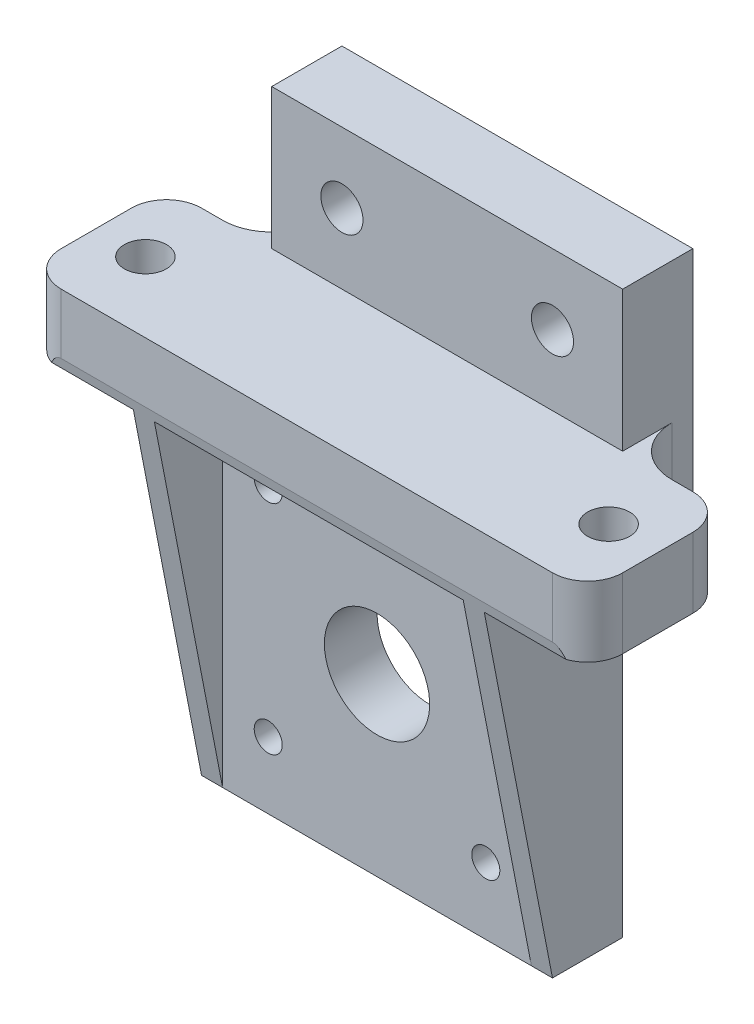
ISO-10303-21;
HEADER;
FILE_DESCRIPTION(('STEP AP214'),'2;1');
FILE_NAME('part.step','',(''),(''),'','','');
FILE_SCHEMA(('AUTOMOTIVE_DESIGN { 1 0 10303 214 1 1 1 1 }'));
ENDSEC;
DATA;
#1=APPLICATION_CONTEXT('core data for automotive mechanical design processes');
#2=APPLICATION_PROTOCOL_DEFINITION('international standard','automotive_design',2000,#1);
#3=PRODUCT_CONTEXT('',#1,'mechanical');
#4=PRODUCT('Part','Part','',(#3));
#5=PRODUCT_RELATED_PRODUCT_CATEGORY('part','',(#4));
#6=PRODUCT_DEFINITION_FORMATION('','',#4);
#7=PRODUCT_DEFINITION_CONTEXT('part definition',#1,'design');
#8=PRODUCT_DEFINITION('design','',#6,#7);
#9=PRODUCT_DEFINITION_SHAPE('','',#8);
#10=(LENGTH_UNIT() NAMED_UNIT(*) SI_UNIT(.MILLI.,.METRE.));
#11=(NAMED_UNIT(*) PLANE_ANGLE_UNIT() SI_UNIT($,.RADIAN.));
#12=(NAMED_UNIT(*) SI_UNIT($,.STERADIAN.) SOLID_ANGLE_UNIT());
#13=UNCERTAINTY_MEASURE_WITH_UNIT(LENGTH_MEASURE(1.E-05),#10,'distance_accuracy_value','');
#14=(GEOMETRIC_REPRESENTATION_CONTEXT(3) GLOBAL_UNCERTAINTY_ASSIGNED_CONTEXT((#13)) GLOBAL_UNIT_ASSIGNED_CONTEXT((#10,
#11,#12)) REPRESENTATION_CONTEXT('',''));
#15=CARTESIAN_POINT('',(0.,0.,0.));
#16=DIRECTION('',(0.,0.,1.));
#17=DIRECTION('',(1.,0.,0.));
#18=AXIS2_PLACEMENT_3D('',#15,#16,#17);
#19=CARTESIAN_POINT('',(0.,0.,10.));
#20=DIRECTION('',(0.,0.,1.));
#21=DIRECTION('',(1.,0.,0.));
#22=AXIS2_PLACEMENT_3D('',#19,#20,#21);
#23=PLANE('',#22);
#24=CARTESIAN_POINT('',(-52.2762597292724,18.5351099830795,10.));
#25=DIRECTION('',(0.,0.,-1.));
#26=DIRECTION('',(-1.,0.,0.));
#27=AXIS2_PLACEMENT_3D('',#24,#25,#26);
#28=CIRCLE('',#27,2.);
#29=CARTESIAN_POINT('',(-54.2762597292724,18.5351099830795,10.));
#30=VERTEX_POINT('',#29);
#31=EDGE_CURVE('E464',#30,#30,#28,.T.);
#32=ORIENTED_EDGE('',*,*,#31,.T.);
#33=EDGE_LOOP('',(#32));
#34=FACE_BOUND('',#33,.T.);
#35=CARTESIAN_POINT('',(-21.2762597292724,18.5351099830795,10.));
#36=DIRECTION('',(0.,0.,-1.));
#37=DIRECTION('',(-1.,0.,0.));
#38=AXIS2_PLACEMENT_3D('',#35,#36,#37);
#39=CIRCLE('',#38,2.);
#40=CARTESIAN_POINT('',(-23.2762597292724,18.5351099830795,10.));
#41=VERTEX_POINT('',#40);
#42=EDGE_CURVE('E471',#41,#41,#39,.T.);
#43=ORIENTED_EDGE('',*,*,#42,.T.);
#44=EDGE_LOOP('',(#43));
#45=FACE_BOUND('',#44,.T.);
#46=CARTESIAN_POINT('',(-21.2762597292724,-12.4648900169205,10.));
#47=DIRECTION('',(0.,0.,-1.));
#48=DIRECTION('',(-1.,0.,0.));
#49=AXIS2_PLACEMENT_3D('',#46,#47,#48);
#50=CIRCLE('',#49,2.);
#51=CARTESIAN_POINT('',(-23.2762597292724,-12.4648900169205,10.));
#52=VERTEX_POINT('',#51);
#53=EDGE_CURVE('E477',#52,#52,#50,.T.);
#54=ORIENTED_EDGE('',*,*,#53,.T.);
#55=EDGE_LOOP('',(#54));
#56=FACE_BOUND('',#55,.T.);
#57=CARTESIAN_POINT('',(-52.2762597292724,-12.4648900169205,10.));
#58=DIRECTION('',(0.,0.,-1.));
#59=DIRECTION('',(-1.,0.,0.));
#60=AXIS2_PLACEMENT_3D('',#57,#58,#59);
#61=CIRCLE('',#60,2.);
#62=CARTESIAN_POINT('',(-54.2762597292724,-12.4648900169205,10.));
#63=VERTEX_POINT('',#62);
#64=EDGE_CURVE('E483',#63,#63,#61,.T.);
#65=ORIENTED_EDGE('',*,*,#64,.T.);
#66=EDGE_LOOP('',(#65));
#67=FACE_BOUND('',#66,.T.);
#68=CARTESIAN_POINT('',(-36.7762597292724,3.03510998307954,10.));
#69=DIRECTION('',(0.,0.,-1.));
#70=DIRECTION('',(-1.,0.,0.));
#71=AXIS2_PLACEMENT_3D('',#68,#69,#70);
#72=CIRCLE('',#71,7.5);
#73=CARTESIAN_POINT('',(-44.2762597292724,3.03510998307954,10.));
#74=VERTEX_POINT('',#73);
#75=EDGE_CURVE('E489',#74,#74,#72,.T.);
#76=ORIENTED_EDGE('',*,*,#75,.T.);
#77=EDGE_LOOP('',(#76));
#78=FACE_BOUND('',#77,.T.);
#79=DIRECTION('',(1.,0.,0.));
#80=VECTOR('',#79,1.);
#81=CARTESIAN_POINT('',(-61.7762597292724,-21.9648900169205,10.));
#82=LINE('',#81,#80);
#83=CARTESIAN_POINT('',(-58.7762597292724,-21.9648900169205,10.));
#84=VERTEX_POINT('',#83);
#85=CARTESIAN_POINT('',(-14.7762597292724,-21.9648900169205,10.));
#86=VERTEX_POINT('',#85);
#87=EDGE_CURVE('E210',#84,#86,#82,.T.);
#88=ORIENTED_EDGE('',*,*,#87,.T.);
#89=DIRECTION('',(0.,-1.,0.));
#90=VECTOR('',#89,1.);
#91=CARTESIAN_POINT('',(-14.7762597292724,-21.9648900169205,10.));
#92=LINE('',#91,#90);
#93=CARTESIAN_POINT('',(-14.7762597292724,23.0351099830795,10.));
#94=VERTEX_POINT('',#93);
#95=EDGE_CURVE('E222',#94,#86,#92,.T.);
#96=ORIENTED_EDGE('',*,*,#95,.F.);
#97=DIRECTION('',(-1.,0.,0.));
#98=VECTOR('',#97,1.);
#99=CARTESIAN_POINT('',(0.,23.0351099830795,10.));
#100=LINE('',#99,#98);
#101=CARTESIAN_POINT('',(-58.7762597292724,23.0351099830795,10.));
#102=VERTEX_POINT('',#101);
#103=EDGE_CURVE('E399',#94,#102,#100,.T.);
#104=ORIENTED_EDGE('',*,*,#103,.T.);
#105=DIRECTION('',(0.,1.,0.));
#106=VECTOR('',#105,1.);
#107=CARTESIAN_POINT('',(-58.7762597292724,-21.9648900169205,10.));
#108=LINE('',#107,#106);
#109=EDGE_CURVE('E233',#84,#102,#108,.T.);
#110=ORIENTED_EDGE('',*,*,#109,.F.);
#111=EDGE_LOOP('',(#88,#96,#104,#110));
#112=FACE_BOUND('',#111,.T.);
#113=ADVANCED_FACE('F33',(#34,#45,#56,#67,#78,#112),#23,.T.);
#114=CARTESIAN_POINT('',(0.,28.0351099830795,0.));
#115=DIRECTION('',(0.,1.,0.));
#116=DIRECTION('',(0.,0.,1.));
#117=AXIS2_PLACEMENT_3D('',#114,#115,#116);
#118=PLANE('',#117);
#119=CARTESIAN_POINT('',(-3.77625972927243,28.0351099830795,10.));
#120=DIRECTION('',(0.,-1.,0.));
#121=DIRECTION('',(0.,0.,-1.));
#122=AXIS2_PLACEMENT_3D('',#119,#120,#121);
#123=CIRCLE('',#122,4.5);
#124=CARTESIAN_POINT('',(-3.77625972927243,28.0351099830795,5.5));
#125=VERTEX_POINT('',#124);
#126=EDGE_CURVE('E352',#125,#125,#123,.T.);
#127=ORIENTED_EDGE('',*,*,#126,.F.);
#128=EDGE_LOOP('',(#127));
#129=FACE_BOUND('',#128,.T.);
#130=CARTESIAN_POINT('',(-1.77625972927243,28.0351099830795,15.));
#131=DIRECTION('',(0.,1.,0.));
#132=DIRECTION('',(0.,0.,1.));
#133=AXIS2_PLACEMENT_3D('',#130,#131,#132);
#134=CIRCLE('',#133,5.);
#135=CARTESIAN_POINT('',(3.22374027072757,28.0351099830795,15.));
#136=VERTEX_POINT('',#135);
#137=CARTESIAN_POINT('',(-0.123718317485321,28.0351099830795,19.719015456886));
#138=VERTEX_POINT('',#137);
#139=EDGE_CURVE('E420',#136,#138,#134,.F.);
#140=ORIENTED_EDGE('',*,*,#139,.T.);
#141=DIRECTION('',(1.,0.,0.));
#142=VECTOR('',#141,1.);
#143=CARTESIAN_POINT('',(-11.7762597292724,28.0351099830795,19.719015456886));
#144=LINE('',#143,#142);
#145=CARTESIAN_POINT('',(-11.7762597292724,28.0351099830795,19.719015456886));
#146=VERTEX_POINT('',#145);
#147=EDGE_CURVE('E251',#138,#146,#144,.F.);
#148=ORIENTED_EDGE('',*,*,#147,.T.);
#149=DIRECTION('',(0.,0.,-1.));
#150=VECTOR('',#149,1.);
#151=CARTESIAN_POINT('',(-11.7762597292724,28.0351099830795,20.));
#152=LINE('',#151,#150);
#153=CARTESIAN_POINT('',(-11.7762597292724,28.0351099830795,-5.));
#154=VERTEX_POINT('',#153);
#155=EDGE_CURVE('E256',#146,#154,#152,.T.);
#156=ORIENTED_EDGE('',*,*,#155,.T.);
#157=DIRECTION('',(0.,0.,-1.));
#158=VECTOR('',#157,1.);
#159=CARTESIAN_POINT('',(-11.7762597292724,28.0351099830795,20.));
#160=LINE('',#159,#158);
#161=CARTESIAN_POINT('',(-11.7762597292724,28.0351099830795,-7.));
#162=VERTEX_POINT('',#161);
#163=EDGE_CURVE('E290',#154,#162,#160,.T.);
#164=ORIENTED_EDGE('',*,*,#163,.T.);
#165=CARTESIAN_POINT('',(-4.77625972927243,28.0351099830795,-7.));
#166=DIRECTION('',(0.,1.,0.));
#167=DIRECTION('',(0.,0.,1.));
#168=AXIS2_PLACEMENT_3D('',#165,#166,#167);
#169=CIRCLE('',#168,7.);
#170=CARTESIAN_POINT('',(-4.77625972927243,28.0351099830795,0.));
#171=VERTEX_POINT('',#170);
#172=EDGE_CURVE('E300',#162,#171,#169,.T.);
#173=ORIENTED_EDGE('',*,*,#172,.T.);
#174=DIRECTION('',(-1.,0.,0.));
#175=VECTOR('',#174,1.);
#176=CARTESIAN_POINT('',(3.22374027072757,28.0351099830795,0.));
#177=LINE('',#176,#175);
#178=CARTESIAN_POINT('',(-1.77625972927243,28.0351099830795,0.));
#179=VERTEX_POINT('',#178);
#180=EDGE_CURVE('E278',#179,#171,#177,.T.);
#181=ORIENTED_EDGE('',*,*,#180,.F.);
#182=CARTESIAN_POINT('',(-1.77625972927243,28.0351099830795,5.));
#183=DIRECTION('',(0.,1.,0.));
#184=DIRECTION('',(0.,0.,1.));
#185=AXIS2_PLACEMENT_3D('',#182,#183,#184);
#186=CIRCLE('',#185,5.);
#187=CARTESIAN_POINT('',(3.22374027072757,28.0351099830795,5.));
#188=VERTEX_POINT('',#187);
#189=EDGE_CURVE('E574',#179,#188,#186,.F.);
#190=ORIENTED_EDGE('',*,*,#189,.T.);
#191=DIRECTION('',(0.,0.,-1.));
#192=VECTOR('',#191,1.);
#193=CARTESIAN_POINT('',(3.22374027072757,28.0351099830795,20.));
#194=LINE('',#193,#192);
#195=EDGE_CURVE('E316',#136,#188,#194,.T.);
#196=ORIENTED_EDGE('',*,*,#195,.F.);
#197=EDGE_LOOP('',(#140,#148,#156,#164,#173,#181,#190,#196));
#198=FACE_BOUND('',#197,.T.);
#199=ADVANCED_FACE('F425',(#129,#198),#118,.F.);
#200=DIRECTION('',(0.,0.,-1.));
#201=VECTOR('',#200,1.);
#202=CARTESIAN_POINT('',(-14.7762597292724,28.0351099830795,20.));
#203=LINE('',#202,#201);
#204=CARTESIAN_POINT('',(-14.7762597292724,28.0351099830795,19.719015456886));
#205=VERTEX_POINT('',#204);
#206=CARTESIAN_POINT('',(-14.7762597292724,28.0351099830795,15.));
#207=VERTEX_POINT('',#206);
#208=EDGE_CURVE('E229',#205,#207,#203,.T.);
#209=ORIENTED_EDGE('',*,*,#208,.F.);
#210=DIRECTION('',(1.,0.,0.));
#211=VECTOR('',#210,1.);
#212=CARTESIAN_POINT('',(-11.7762597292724,28.0351099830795,19.719015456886));
#213=LINE('',#212,#211);
#214=CARTESIAN_POINT('',(-58.7762597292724,28.0351099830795,19.719015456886));
#215=VERTEX_POINT('',#214);
#216=EDGE_CURVE('E238',#205,#215,#213,.F.);
#217=ORIENTED_EDGE('',*,*,#216,.T.);
#218=DIRECTION('',(0.,0.,-1.));
#219=VECTOR('',#218,1.);
#220=CARTESIAN_POINT('',(-58.7762597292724,28.0351099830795,20.));
#221=LINE('',#220,#219);
#222=CARTESIAN_POINT('',(-58.7762597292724,28.0351099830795,15.));
#223=VERTEX_POINT('',#222);
#224=EDGE_CURVE('E249',#215,#223,#221,.T.);
#225=ORIENTED_EDGE('',*,*,#224,.T.);
#226=DIRECTION('',(-1.,0.,0.));
#227=VECTOR('',#226,1.);
#228=CARTESIAN_POINT('',(0.,28.0351099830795,15.));
#229=LINE('',#228,#227);
#230=EDGE_CURVE('E398',#223,#207,#229,.F.);
#231=ORIENTED_EDGE('',*,*,#230,.T.);
#232=EDGE_LOOP('',(#209,#217,#225,#231));
#233=FACE_BOUND('',#232,.T.);
#234=ADVANCED_FACE('F400',(#233),#118,.F.);
#235=CARTESIAN_POINT('',(0.,23.0351099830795,15.));
#236=DIRECTION('',(-1.,0.,0.));
#237=DIRECTION('',(0.,0.,1.));
#238=AXIS2_PLACEMENT_3D('',#235,#236,#237);
#239=CYLINDRICAL_SURFACE('',#238,5.);
#240=CARTESIAN_POINT('',(-14.7762597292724,23.0351099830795,15.));
#241=DIRECTION('',(1.,0.,0.));
#242=DIRECTION('',(0.,0.,-1.));
#243=AXIS2_PLACEMENT_3D('',#240,#241,#242);
#244=CIRCLE('',#243,5.);
#245=EDGE_CURVE('E226',#207,#94,#244,.F.);
#246=ORIENTED_EDGE('',*,*,#245,.F.);
#247=ORIENTED_EDGE('',*,*,#230,.F.);
#248=CARTESIAN_POINT('',(-58.7762597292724,23.0351099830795,15.));
#249=DIRECTION('',(-1.,0.,0.));
#250=DIRECTION('',(0.,0.,1.));
#251=AXIS2_PLACEMENT_3D('',#248,#249,#250);
#252=CIRCLE('',#251,5.);
#253=EDGE_CURVE('E401',#102,#223,#252,.F.);
#254=ORIENTED_EDGE('',*,*,#253,.F.);
#255=ORIENTED_EDGE('',*,*,#103,.F.);
#256=EDGE_LOOP('',(#246,#247,#254,#255));
#257=FACE_BOUND('',#256,.T.);
#258=ADVANCED_FACE('F396',(#257),#239,.F.);
#259=CARTESIAN_POINT('',(-69.7762597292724,28.0351099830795,10.));
#260=DIRECTION('',(0.,-1.,0.));
#261=DIRECTION('',(0.,0.,-1.));
#262=AXIS2_PLACEMENT_3D('',#259,#260,#261);
#263=CIRCLE('',#262,4.5);
#264=CARTESIAN_POINT('',(-69.7762597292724,28.0351099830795,5.5));
#265=VERTEX_POINT('',#264);
#266=EDGE_CURVE('E346',#265,#265,#263,.T.);
#267=ORIENTED_EDGE('',*,*,#266,.F.);
#268=EDGE_LOOP('',(#267));
#269=FACE_BOUND('',#268,.T.);
#270=DIRECTION('',(0.,0.,1.));
#271=VECTOR('',#270,1.);
#272=CARTESIAN_POINT('',(-61.7762597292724,28.0351099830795,20.));
#273=LINE('',#272,#271);
#274=CARTESIAN_POINT('',(-61.7762597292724,28.0351099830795,-5.));
#275=VERTEX_POINT('',#274);
#276=CARTESIAN_POINT('',(-61.7762597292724,28.0351099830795,19.719015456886));
#277=VERTEX_POINT('',#276);
#278=EDGE_CURVE('E271',#275,#277,#273,.T.);
#279=ORIENTED_EDGE('',*,*,#278,.T.);
#280=DIRECTION('',(1.,0.,0.));
#281=VECTOR('',#280,1.);
#282=CARTESIAN_POINT('',(-11.7762597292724,28.0351099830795,19.719015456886));
#283=LINE('',#282,#281);
#284=CARTESIAN_POINT('',(-73.4288011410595,28.0351099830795,19.719015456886));
#285=VERTEX_POINT('',#284);
#286=EDGE_CURVE('E41',#277,#285,#283,.F.);
#287=ORIENTED_EDGE('',*,*,#286,.T.);
#288=CARTESIAN_POINT('',(-71.7762597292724,28.0351099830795,15.));
#289=DIRECTION('',(0.,1.,0.));
#290=DIRECTION('',(0.,0.,1.));
#291=AXIS2_PLACEMENT_3D('',#288,#289,#290);
#292=CIRCLE('',#291,5.);
#293=CARTESIAN_POINT('',(-76.7762597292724,28.0351099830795,15.));
#294=VERTEX_POINT('',#293);
#295=EDGE_CURVE('E585',#285,#294,#292,.F.);
#296=ORIENTED_EDGE('',*,*,#295,.T.);
#297=DIRECTION('',(0.,0.,1.));
#298=VECTOR('',#297,1.);
#299=CARTESIAN_POINT('',(-76.7762597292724,28.0351099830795,20.));
#300=LINE('',#299,#298);
#301=CARTESIAN_POINT('',(-76.7762597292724,28.0351099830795,5.));
#302=VERTEX_POINT('',#301);
#303=EDGE_CURVE('E270',#302,#294,#300,.T.);
#304=ORIENTED_EDGE('',*,*,#303,.F.);
#305=CARTESIAN_POINT('',(-71.7762597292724,28.0351099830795,5.));
#306=DIRECTION('',(0.,1.,0.));
#307=DIRECTION('',(0.,0.,1.));
#308=AXIS2_PLACEMENT_3D('',#305,#306,#307);
#309=CIRCLE('',#308,5.);
#310=CARTESIAN_POINT('',(-71.7762597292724,28.0351099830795,0.));
#311=VERTEX_POINT('',#310);
#312=EDGE_CURVE('E590',#302,#311,#309,.F.);
#313=ORIENTED_EDGE('',*,*,#312,.T.);
#314=DIRECTION('',(1.,0.,0.));
#315=VECTOR('',#314,1.);
#316=CARTESIAN_POINT('',(-76.7762597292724,28.0351099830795,0.));
#317=LINE('',#316,#315);
#318=CARTESIAN_POINT('',(-68.7762597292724,28.0351099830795,0.));
#319=VERTEX_POINT('',#318);
#320=EDGE_CURVE('E274',#311,#319,#317,.T.);
#321=ORIENTED_EDGE('',*,*,#320,.T.);
#322=CARTESIAN_POINT('',(-68.7762597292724,28.0351099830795,-7.));
#323=DIRECTION('',(0.,1.,0.));
#324=DIRECTION('',(0.,0.,1.));
#325=AXIS2_PLACEMENT_3D('',#322,#323,#324);
#326=CIRCLE('',#325,7.);
#327=CARTESIAN_POINT('',(-61.7762597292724,28.0351099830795,-7.));
#328=VERTEX_POINT('',#327);
#329=EDGE_CURVE('E457',#319,#328,#326,.T.);
#330=ORIENTED_EDGE('',*,*,#329,.T.);
#331=DIRECTION('',(0.,0.,1.));
#332=VECTOR('',#331,1.);
#333=CARTESIAN_POINT('',(-61.7762597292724,28.0351099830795,20.));
#334=LINE('',#333,#332);
#335=EDGE_CURVE('E446',#328,#275,#334,.T.);
#336=ORIENTED_EDGE('',*,*,#335,.T.);
#337=EDGE_LOOP('',(#279,#287,#296,#304,#313,#321,#330,#336));
#338=FACE_BOUND('',#337,.T.);
#339=ADVANCED_FACE('F608',(#269,#338),#118,.F.);
#340=CARTESIAN_POINT('',(-21.7762597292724,48.0351099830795,-10.));
#341=DIRECTION('',(0.,0.,1.));
#342=DIRECTION('',(1.,0.,0.));
#343=AXIS2_PLACEMENT_3D('',#340,#341,#342);
#344=CYLINDRICAL_SURFACE('',#343,3.);
#345=CARTESIAN_POINT('',(-21.7762597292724,48.0351099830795,0.));
#346=DIRECTION('',(0.,0.,1.));
#347=DIRECTION('',(1.,0.,0.));
#348=AXIS2_PLACEMENT_3D('',#345,#346,#347);
#349=CIRCLE('',#348,3.);
#350=CARTESIAN_POINT('',(-18.7762597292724,48.0351099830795,0.));
#351=VERTEX_POINT('',#350);
#352=EDGE_CURVE('E372',#351,#351,#349,.T.);
#353=ORIENTED_EDGE('',*,*,#352,.T.);
#354=EDGE_LOOP('',(#353));
#355=FACE_BOUND('',#354,.T.);
#356=CARTESIAN_POINT('',(-21.7762597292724,48.0351099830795,-7.));
#357=DIRECTION('',(0.,0.,-1.));
#358=DIRECTION('',(-1.,0.,0.));
#359=AXIS2_PLACEMENT_3D('',#356,#357,#358);
#360=CIRCLE('',#359,3.);
#361=CARTESIAN_POINT('',(-24.7762597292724,48.0351099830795,-7.));
#362=VERTEX_POINT('',#361);
#363=EDGE_CURVE('E380',#362,#362,#360,.F.);
#364=ORIENTED_EDGE('',*,*,#363,.F.);
#365=EDGE_LOOP('',(#364));
#366=FACE_BOUND('',#365,.T.);
#367=ADVANCED_FACE('F682',(#355,#366),#344,.F.);
#368=CARTESIAN_POINT('',(-51.7762597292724,48.0351099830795,-10.));
#369=DIRECTION('',(0.,0.,1.));
#370=DIRECTION('',(1.,0.,0.));
#371=AXIS2_PLACEMENT_3D('',#368,#369,#370);
#372=CYLINDRICAL_SURFACE('',#371,3.);
#373=CARTESIAN_POINT('',(-51.7762597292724,48.0351099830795,0.));
#374=DIRECTION('',(0.,0.,1.));
#375=DIRECTION('',(1.,0.,0.));
#376=AXIS2_PLACEMENT_3D('',#373,#374,#375);
#377=CIRCLE('',#376,3.);
#378=CARTESIAN_POINT('',(-48.7762597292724,48.0351099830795,0.));
#379=VERTEX_POINT('',#378);
#380=EDGE_CURVE('E369',#379,#379,#377,.T.);
#381=ORIENTED_EDGE('',*,*,#380,.T.);
#382=EDGE_LOOP('',(#381));
#383=FACE_BOUND('',#382,.T.);
#384=CARTESIAN_POINT('',(-51.7762597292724,48.0351099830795,-7.));
#385=DIRECTION('',(0.,0.,-1.));
#386=DIRECTION('',(-1.,0.,0.));
#387=AXIS2_PLACEMENT_3D('',#384,#385,#386);
#388=CIRCLE('',#387,3.);
#389=CARTESIAN_POINT('',(-54.7762597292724,48.0351099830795,-7.));
#390=VERTEX_POINT('',#389);
#391=EDGE_CURVE('E375',#390,#390,#388,.F.);
#392=ORIENTED_EDGE('',*,*,#391,.F.);
#393=EDGE_LOOP('',(#392));
#394=FACE_BOUND('',#393,.T.);
#395=ADVANCED_FACE('F789',(#383,#394),#372,.F.);
#396=CARTESIAN_POINT('',(-11.7762597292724,28.0351099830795,10.));
#397=DIRECTION('',(-1.,0.,0.));
#398=DIRECTION('',(0.,-1.,0.));
#399=AXIS2_PLACEMENT_3D('',#396,#397,#398);
#400=PLANE('',#399);
#401=DIRECTION('',(0.,-1.,0.));
#402=VECTOR('',#401,1.);
#403=CARTESIAN_POINT('',(-11.7762597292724,38.0351099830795,-10.));
#404=LINE('',#403,#402);
#405=CARTESIAN_POINT('',(-11.7762597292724,58.0351099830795,-10.));
#406=VERTEX_POINT('',#405);
#407=CARTESIAN_POINT('',(-11.7762597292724,28.0351099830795,-10.));
#408=VERTEX_POINT('',#407);
#409=EDGE_CURVE('E463',#406,#408,#404,.T.);
#410=ORIENTED_EDGE('',*,*,#409,.F.);
#411=DIRECTION('',(0.,0.,-1.));
#412=VECTOR('',#411,1.);
#413=CARTESIAN_POINT('',(-11.7762597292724,58.0351099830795,-10.));
#414=LINE('',#413,#412);
#415=CARTESIAN_POINT('',(-11.7762597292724,58.0351099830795,0.));
#416=VERTEX_POINT('',#415);
#417=EDGE_CURVE('E338',#416,#406,#414,.T.);
#418=ORIENTED_EDGE('',*,*,#417,.F.);
#419=DIRECTION('',(0.,-1.,0.));
#420=VECTOR('',#419,1.);
#421=CARTESIAN_POINT('',(-11.7762597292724,58.0351099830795,0.));
#422=LINE('',#421,#420);
#423=CARTESIAN_POINT('',(-11.7762597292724,38.0351099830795,0.));
#424=VERTEX_POINT('',#423);
#425=EDGE_CURVE('E325',#416,#424,#422,.T.);
#426=ORIENTED_EDGE('',*,*,#425,.T.);
#427=DIRECTION('',(0.,0.,-1.));
#428=VECTOR('',#427,1.);
#429=CARTESIAN_POINT('',(-11.7762597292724,38.0351099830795,-10.));
#430=LINE('',#429,#428);
#431=CARTESIAN_POINT('',(-11.7762597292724,38.0351099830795,-7.));
#432=VERTEX_POINT('',#431);
#433=EDGE_CURVE('E309',#424,#432,#430,.T.);
#434=ORIENTED_EDGE('',*,*,#433,.T.);
#435=DIRECTION('',(0.,1.,0.));
#436=VECTOR('',#435,1.);
#437=CARTESIAN_POINT('',(-11.7762597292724,28.0351099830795,-7.));
#438=LINE('',#437,#436);
#439=EDGE_CURVE('E540',#432,#162,#438,.F.);
#440=ORIENTED_EDGE('',*,*,#439,.T.);
#441=EDGE_CURVE('E294',#162,#408,#160,.T.);
#442=ORIENTED_EDGE('',*,*,#441,.T.);
#443=EDGE_LOOP('',(#410,#418,#426,#434,#440,#442));
#444=FACE_BOUND('',#443,.T.);
#445=ADVANCED_FACE('F617',(#444),#400,.F.);
#446=CARTESIAN_POINT('',(-61.7762597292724,28.0351099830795,10.));
#447=DIRECTION('',(1.,0.,0.));
#448=DIRECTION('',(0.,1.,0.));
#449=AXIS2_PLACEMENT_3D('',#446,#447,#448);
#450=PLANE('',#449);
#451=DIRECTION('',(0.,0.,-1.));
#452=VECTOR('',#451,1.);
#453=CARTESIAN_POINT('',(-61.7762597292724,-21.9648900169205,10.));
#454=LINE('',#453,#452);
#455=CARTESIAN_POINT('',(-61.7762597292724,-21.9648900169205,9.99999999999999));
#456=VERTEX_POINT('',#455);
#457=CARTESIAN_POINT('',(-61.7762597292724,-21.9648900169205,0.));
#458=VERTEX_POINT('',#457);
#459=EDGE_CURVE('E260',#456,#458,#454,.T.);
#460=ORIENTED_EDGE('',*,*,#459,.F.);
#461=DIRECTION('',(0.,-0.981627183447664,-0.190808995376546));
#462=VECTOR('',#461,1.);
#463=CARTESIAN_POINT('',(-61.7762597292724,29.4806501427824,20.));
#464=LINE('',#463,#462);
#465=EDGE_CURVE('E55',#456,#277,#464,.F.);
#466=ORIENTED_EDGE('',*,*,#465,.T.);
#467=ORIENTED_EDGE('',*,*,#278,.F.);
#468=CARTESIAN_POINT('',(-61.7762597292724,23.0351099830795,-5.));
#469=DIRECTION('',(1.,0.,0.));
#470=DIRECTION('',(0.,1.,0.));
#471=AXIS2_PLACEMENT_3D('',#468,#469,#470);
#472=CIRCLE('',#471,5.);
#473=CARTESIAN_POINT('',(-61.7762597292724,23.0351099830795,0.));
#474=VERTEX_POINT('',#473);
#475=EDGE_CURVE('E517',#275,#474,#472,.T.);
#476=ORIENTED_EDGE('',*,*,#475,.T.);
#477=DIRECTION('',(0.,-1.,0.));
#478=VECTOR('',#477,1.);
#479=CARTESIAN_POINT('',(-61.7762597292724,28.0351099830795,0.));
#480=LINE('',#479,#478);
#481=EDGE_CURVE('E498',#474,#458,#480,.T.);
#482=ORIENTED_EDGE('',*,*,#481,.T.);
#483=EDGE_LOOP('',(#460,#466,#467,#476,#482));
#484=FACE_BOUND('',#483,.T.);
#485=ADVANCED_FACE('F654',(#484),#450,.F.);
#486=ORIENTED_EDGE('',*,*,#155,.F.);
#487=DIRECTION('',(0.,0.981627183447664,0.190808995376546));
#488=VECTOR('',#487,1.);
#489=CARTESIAN_POINT('',(-11.7762597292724,29.4806501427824,20.));
#490=LINE('',#489,#488);
#491=CARTESIAN_POINT('',(-11.7762597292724,-21.9648900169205,9.99999999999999));
#492=VERTEX_POINT('',#491);
#493=EDGE_CURVE('E250',#146,#492,#490,.F.);
#494=ORIENTED_EDGE('',*,*,#493,.T.);
#495=DIRECTION('',(0.,0.,-1.));
#496=VECTOR('',#495,1.);
#497=CARTESIAN_POINT('',(-11.7762597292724,-21.9648900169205,10.));
#498=LINE('',#497,#496);
#499=CARTESIAN_POINT('',(-11.7762597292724,-21.9648900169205,0.));
#500=VERTEX_POINT('',#499);
#501=EDGE_CURVE('E213',#492,#500,#498,.T.);
#502=ORIENTED_EDGE('',*,*,#501,.T.);
#503=DIRECTION('',(0.,1.,0.));
#504=VECTOR('',#503,1.);
#505=CARTESIAN_POINT('',(-11.7762597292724,28.0351099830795,0.));
#506=LINE('',#505,#504);
#507=CARTESIAN_POINT('',(-11.7762597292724,23.0351099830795,0.));
#508=VERTEX_POINT('',#507);
#509=EDGE_CURVE('E234',#500,#508,#506,.T.);
#510=ORIENTED_EDGE('',*,*,#509,.T.);
#511=CARTESIAN_POINT('',(-11.7762597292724,23.0351099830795,-5.));
#512=DIRECTION('',(-1.,0.,0.));
#513=DIRECTION('',(0.,-1.,0.));
#514=AXIS2_PLACEMENT_3D('',#511,#512,#513);
#515=CIRCLE('',#514,5.);
#516=EDGE_CURVE('E433',#508,#154,#515,.T.);
#517=ORIENTED_EDGE('',*,*,#516,.T.);
#518=EDGE_LOOP('',(#486,#494,#502,#510,#517));
#519=FACE_BOUND('',#518,.T.);
#520=ADVANCED_FACE('F429',(#519),#400,.F.);
#521=CARTESIAN_POINT('',(-61.7762597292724,28.0351099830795,-9.99999999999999));
#522=VERTEX_POINT('',#521);
#523=EDGE_CURVE('E283',#522,#328,#334,.T.);
#524=ORIENTED_EDGE('',*,*,#523,.T.);
#525=DIRECTION('',(0.,-1.,0.));
#526=VECTOR('',#525,1.);
#527=CARTESIAN_POINT('',(-61.7762597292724,38.0351099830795,-7.));
#528=LINE('',#527,#526);
#529=CARTESIAN_POINT('',(-61.7762597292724,38.0351099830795,-7.));
#530=VERTEX_POINT('',#529);
#531=EDGE_CURVE('E520',#328,#530,#528,.F.);
#532=ORIENTED_EDGE('',*,*,#531,.T.);
#533=DIRECTION('',(0.,0.,1.));
#534=VECTOR('',#533,1.);
#535=CARTESIAN_POINT('',(-61.7762597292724,38.0351099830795,-9.99999999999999));
#536=LINE('',#535,#534);
#537=CARTESIAN_POINT('',(-61.7762597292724,38.0351099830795,0.));
#538=VERTEX_POINT('',#537);
#539=EDGE_CURVE('E302',#530,#538,#536,.T.);
#540=ORIENTED_EDGE('',*,*,#539,.T.);
#541=DIRECTION('',(0.,-1.,0.));
#542=VECTOR('',#541,1.);
#543=CARTESIAN_POINT('',(-61.7762597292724,58.0351099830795,0.));
#544=LINE('',#543,#542);
#545=CARTESIAN_POINT('',(-61.7762597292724,58.0351099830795,0.));
#546=VERTEX_POINT('',#545);
#547=EDGE_CURVE('E314',#546,#538,#544,.T.);
#548=ORIENTED_EDGE('',*,*,#547,.F.);
#549=DIRECTION('',(0.,0.,1.));
#550=VECTOR('',#549,1.);
#551=CARTESIAN_POINT('',(-61.7762597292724,58.0351099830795,-9.99999999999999));
#552=LINE('',#551,#550);
#553=CARTESIAN_POINT('',(-61.7762597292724,58.0351099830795,-9.99999999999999));
#554=VERTEX_POINT('',#553);
#555=EDGE_CURVE('E335',#554,#546,#552,.T.);
#556=ORIENTED_EDGE('',*,*,#555,.F.);
#557=DIRECTION('',(0.,-1.,0.));
#558=VECTOR('',#557,1.);
#559=CARTESIAN_POINT('',(-61.7762597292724,38.0351099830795,-9.99999999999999));
#560=LINE('',#559,#558);
#561=EDGE_CURVE('E282',#554,#522,#560,.T.);
#562=ORIENTED_EDGE('',*,*,#561,.T.);
#563=EDGE_LOOP('',(#524,#532,#540,#548,#556,#562));
#564=FACE_BOUND('',#563,.T.);
#565=ADVANCED_FACE('F613',(#564),#450,.F.);
#566=CARTESIAN_POINT('',(-61.7762597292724,-21.9648900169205,10.));
#567=DIRECTION('',(0.,1.,0.));
#568=DIRECTION('',(0.,0.,1.));
#569=AXIS2_PLACEMENT_3D('',#566,#567,#568);
#570=PLANE('',#569);
#571=ORIENTED_EDGE('',*,*,#501,.F.);
#572=DIRECTION('',(1.,0.,0.));
#573=VECTOR('',#572,1.);
#574=CARTESIAN_POINT('',(-11.7762597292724,-21.9648900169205,9.99999999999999));
#575=LINE('',#574,#573);
#576=EDGE_CURVE('E206',#492,#86,#575,.F.);
#577=ORIENTED_EDGE('',*,*,#576,.T.);
#578=ORIENTED_EDGE('',*,*,#87,.F.);
#579=DIRECTION('',(-1.,0.,0.));
#580=VECTOR('',#579,1.);
#581=CARTESIAN_POINT('',(-61.7762597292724,-21.9648900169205,9.99999999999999));
#582=LINE('',#581,#580);
#583=EDGE_CURVE('E218',#84,#456,#582,.T.);
#584=ORIENTED_EDGE('',*,*,#583,.T.);
#585=ORIENTED_EDGE('',*,*,#459,.T.);
#586=DIRECTION('',(1.,0.,0.));
#587=VECTOR('',#586,1.);
#588=CARTESIAN_POINT('',(-61.7762597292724,-21.9648900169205,0.));
#589=LINE('',#588,#587);
#590=EDGE_CURVE('E501',#458,#500,#589,.T.);
#591=ORIENTED_EDGE('',*,*,#590,.T.);
#592=EDGE_LOOP('',(#571,#577,#578,#584,#585,#591));
#593=FACE_BOUND('',#592,.T.);
#594=ADVANCED_FACE('F208',(#593),#570,.F.);
#595=CARTESIAN_POINT('',(0.,0.,0.));
#596=DIRECTION('',(0.,0.,1.));
#597=DIRECTION('',(1.,0.,0.));
#598=AXIS2_PLACEMENT_3D('',#595,#596,#597);
#599=PLANE('',#598);
#600=CARTESIAN_POINT('',(-52.2762597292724,18.5351099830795,0.));
#601=DIRECTION('',(0.,0.,-1.));
#602=DIRECTION('',(-1.,0.,0.));
#603=AXIS2_PLACEMENT_3D('',#600,#601,#602);
#604=CIRCLE('',#603,2.);
#605=CARTESIAN_POINT('',(-54.2762597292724,18.5351099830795,0.));
#606=VERTEX_POINT('',#605);
#607=EDGE_CURVE('E468',#606,#606,#604,.T.);
#608=ORIENTED_EDGE('',*,*,#607,.F.);
#609=EDGE_LOOP('',(#608));
#610=FACE_BOUND('',#609,.T.);
#611=CARTESIAN_POINT('',(-21.2762597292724,18.5351099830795,0.));
#612=DIRECTION('',(0.,0.,-1.));
#613=DIRECTION('',(-1.,0.,0.));
#614=AXIS2_PLACEMENT_3D('',#611,#612,#613);
#615=CIRCLE('',#614,2.);
#616=CARTESIAN_POINT('',(-23.2762597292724,18.5351099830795,0.));
#617=VERTEX_POINT('',#616);
#618=EDGE_CURVE('E467',#617,#617,#615,.T.);
#619=ORIENTED_EDGE('',*,*,#618,.F.);
#620=EDGE_LOOP('',(#619));
#621=FACE_BOUND('',#620,.T.);
#622=CARTESIAN_POINT('',(-21.2762597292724,-12.4648900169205,0.));
#623=DIRECTION('',(0.,0.,-1.));
#624=DIRECTION('',(-1.,0.,0.));
#625=AXIS2_PLACEMENT_3D('',#622,#623,#624);
#626=CIRCLE('',#625,2.);
#627=CARTESIAN_POINT('',(-23.2762597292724,-12.4648900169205,0.));
#628=VERTEX_POINT('',#627);
#629=EDGE_CURVE('E474',#628,#628,#626,.T.);
#630=ORIENTED_EDGE('',*,*,#629,.F.);
#631=EDGE_LOOP('',(#630));
#632=FACE_BOUND('',#631,.T.);
#633=CARTESIAN_POINT('',(-52.2762597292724,-12.4648900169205,0.));
#634=DIRECTION('',(0.,0.,-1.));
#635=DIRECTION('',(-1.,0.,0.));
#636=AXIS2_PLACEMENT_3D('',#633,#634,#635);
#637=CIRCLE('',#636,2.);
#638=CARTESIAN_POINT('',(-54.2762597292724,-12.4648900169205,0.));
#639=VERTEX_POINT('',#638);
#640=EDGE_CURVE('E480',#639,#639,#637,.T.);
#641=ORIENTED_EDGE('',*,*,#640,.F.);
#642=EDGE_LOOP('',(#641));
#643=FACE_BOUND('',#642,.T.);
#644=CARTESIAN_POINT('',(-36.7762597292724,3.03510998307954,0.));
#645=DIRECTION('',(0.,0.,-1.));
#646=DIRECTION('',(-1.,0.,0.));
#647=AXIS2_PLACEMENT_3D('',#644,#645,#646);
#648=CIRCLE('',#647,11.125);
#649=CARTESIAN_POINT('',(-47.9012597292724,3.03510998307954,0.));
#650=VERTEX_POINT('',#649);
#651=EDGE_CURVE('E492',#650,#650,#648,.T.);
#652=ORIENTED_EDGE('',*,*,#651,.F.);
#653=EDGE_LOOP('',(#652));
#654=FACE_BOUND('',#653,.T.);
#655=ORIENTED_EDGE('',*,*,#481,.F.);
#656=DIRECTION('',(-1.,0.,0.));
#657=VECTOR('',#656,1.);
#658=CARTESIAN_POINT('',(-11.7762597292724,23.0351099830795,0.));
#659=LINE('',#658,#657);
#660=EDGE_CURVE('E515',#474,#508,#659,.F.);
#661=ORIENTED_EDGE('',*,*,#660,.T.);
#662=ORIENTED_EDGE('',*,*,#509,.F.);
#663=ORIENTED_EDGE('',*,*,#590,.F.);
#664=EDGE_LOOP('',(#655,#661,#662,#663));
#665=FACE_BOUND('',#664,.T.);
#666=ADVANCED_FACE('F648',(#610,#621,#632,#643,#654,#665),#599,.F.);
#667=CARTESIAN_POINT('',(-36.7762597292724,3.03510998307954,2.5));
#668=DIRECTION('',(0.,0.,-1.));
#669=DIRECTION('',(-1.,0.,0.));
#670=AXIS2_PLACEMENT_3D('',#667,#668,#669);
#671=CYLINDRICAL_SURFACE('',#670,11.125);
#672=CARTESIAN_POINT('',(-36.7762597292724,3.03510998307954,2.5));
#673=DIRECTION('',(0.,0.,-1.));
#674=DIRECTION('',(-1.,0.,0.));
#675=AXIS2_PLACEMENT_3D('',#672,#673,#674);
#676=CIRCLE('',#675,11.125);
#677=CARTESIAN_POINT('',(-47.9012597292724,3.03510998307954,2.5));
#678=VERTEX_POINT('',#677);
#679=EDGE_CURVE('E495',#678,#678,#676,.T.);
#680=ORIENTED_EDGE('',*,*,#679,.F.);
#681=EDGE_LOOP('',(#680));
#682=FACE_BOUND('',#681,.T.);
#683=ORIENTED_EDGE('',*,*,#651,.T.);
#684=EDGE_LOOP('',(#683));
#685=FACE_BOUND('',#684,.T.);
#686=ADVANCED_FACE('F646',(#682,#685),#671,.F.);
#687=CARTESIAN_POINT('',(-36.7762597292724,3.03510998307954,2.5));
#688=DIRECTION('',(0.,0.,-1.));
#689=DIRECTION('',(-1.,0.,0.));
#690=AXIS2_PLACEMENT_3D('',#687,#688,#689);
#691=PLANE('',#690);
#692=CARTESIAN_POINT('',(-36.7762597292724,3.03510998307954,2.5));
#693=DIRECTION('',(0.,0.,-1.));
#694=DIRECTION('',(-1.,0.,0.));
#695=AXIS2_PLACEMENT_3D('',#692,#693,#694);
#696=CIRCLE('',#695,7.5);
#697=CARTESIAN_POINT('',(-44.2762597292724,3.03510998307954,2.5));
#698=VERTEX_POINT('',#697);
#699=EDGE_CURVE('E486',#698,#698,#696,.T.);
#700=ORIENTED_EDGE('',*,*,#699,.F.);
#701=EDGE_LOOP('',(#700));
#702=FACE_BOUND('',#701,.T.);
#703=ORIENTED_EDGE('',*,*,#679,.T.);
#704=EDGE_LOOP('',(#703));
#705=FACE_BOUND('',#704,.T.);
#706=ADVANCED_FACE('F718',(#702,#705),#691,.T.);
#707=CARTESIAN_POINT('',(-36.7762597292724,3.03510998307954,10.));
#708=DIRECTION('',(0.,0.,-1.));
#709=DIRECTION('',(-1.,0.,0.));
#710=AXIS2_PLACEMENT_3D('',#707,#708,#709);
#711=CYLINDRICAL_SURFACE('',#710,7.5);
#712=ORIENTED_EDGE('',*,*,#75,.F.);
#713=EDGE_LOOP('',(#712));
#714=FACE_BOUND('',#713,.T.);
#715=ORIENTED_EDGE('',*,*,#699,.T.);
#716=EDGE_LOOP('',(#715));
#717=FACE_BOUND('',#716,.T.);
#718=ADVANCED_FACE('F715',(#714,#717),#711,.F.);
#719=CARTESIAN_POINT('',(-52.2762597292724,-12.4648900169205,10.));
#720=DIRECTION('',(0.,0.,-1.));
#721=DIRECTION('',(-1.,0.,0.));
#722=AXIS2_PLACEMENT_3D('',#719,#720,#721);
#723=CYLINDRICAL_SURFACE('',#722,2.);
#724=ORIENTED_EDGE('',*,*,#64,.F.);
#725=EDGE_LOOP('',(#724));
#726=FACE_BOUND('',#725,.T.);
#727=ORIENTED_EDGE('',*,*,#640,.T.);
#728=EDGE_LOOP('',(#727));
#729=FACE_BOUND('',#728,.T.);
#730=ADVANCED_FACE('F711',(#726,#729),#723,.F.);
#731=CARTESIAN_POINT('',(-21.2762597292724,-12.4648900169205,10.));
#732=DIRECTION('',(0.,0.,-1.));
#733=DIRECTION('',(-1.,0.,0.));
#734=AXIS2_PLACEMENT_3D('',#731,#732,#733);
#735=CYLINDRICAL_SURFACE('',#734,2.);
#736=ORIENTED_EDGE('',*,*,#53,.F.);
#737=EDGE_LOOP('',(#736));
#738=FACE_BOUND('',#737,.T.);
#739=ORIENTED_EDGE('',*,*,#629,.T.);
#740=EDGE_LOOP('',(#739));
#741=FACE_BOUND('',#740,.T.);
#742=ADVANCED_FACE('F703',(#738,#741),#735,.F.);
#743=CARTESIAN_POINT('',(-21.2762597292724,18.5351099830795,10.));
#744=DIRECTION('',(0.,0.,-1.));
#745=DIRECTION('',(-1.,0.,0.));
#746=AXIS2_PLACEMENT_3D('',#743,#744,#745);
#747=CYLINDRICAL_SURFACE('',#746,2.);
#748=ORIENTED_EDGE('',*,*,#42,.F.);
#749=EDGE_LOOP('',(#748));
#750=FACE_BOUND('',#749,.T.);
#751=ORIENTED_EDGE('',*,*,#618,.T.);
#752=EDGE_LOOP('',(#751));
#753=FACE_BOUND('',#752,.T.);
#754=ADVANCED_FACE('F697',(#750,#753),#747,.F.);
#755=CARTESIAN_POINT('',(-52.2762597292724,18.5351099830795,10.));
#756=DIRECTION('',(0.,0.,-1.));
#757=DIRECTION('',(-1.,0.,0.));
#758=AXIS2_PLACEMENT_3D('',#755,#756,#757);
#759=CYLINDRICAL_SURFACE('',#758,2.);
#760=ORIENTED_EDGE('',*,*,#31,.F.);
#761=EDGE_LOOP('',(#760));
#762=FACE_BOUND('',#761,.T.);
#763=ORIENTED_EDGE('',*,*,#607,.T.);
#764=EDGE_LOOP('',(#763));
#765=FACE_BOUND('',#764,.T.);
#766=ADVANCED_FACE('F689',(#762,#765),#759,.F.);
#767=ORIENTED_EDGE('',*,*,#163,.F.);
#768=DIRECTION('',(-1.,0.,0.));
#769=VECTOR('',#768,1.);
#770=CARTESIAN_POINT('',(-61.7762597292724,28.0351099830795,-5.));
#771=LINE('',#770,#769);
#772=EDGE_CURVE('E442',#154,#275,#771,.T.);
#773=ORIENTED_EDGE('',*,*,#772,.T.);
#774=ORIENTED_EDGE('',*,*,#335,.F.);
#775=ORIENTED_EDGE('',*,*,#523,.F.);
#776=DIRECTION('',(-1.,0.,0.));
#777=VECTOR('',#776,1.);
#778=CARTESIAN_POINT('',(-11.7762597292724,28.0351099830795,-10.));
#779=LINE('',#778,#777);
#780=EDGE_CURVE('E286',#408,#522,#779,.T.);
#781=ORIENTED_EDGE('',*,*,#780,.F.);
#782=ORIENTED_EDGE('',*,*,#441,.F.);
#783=EDGE_LOOP('',(#767,#773,#774,#775,#781,#782));
#784=FACE_BOUND('',#783,.T.);
#785=ADVANCED_FACE('F440',(#784),#118,.F.);
#786=CARTESIAN_POINT('',(-11.7762597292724,38.0351099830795,-10.));
#787=DIRECTION('',(0.,0.,1.));
#788=DIRECTION('',(1.,0.,0.));
#789=AXIS2_PLACEMENT_3D('',#786,#787,#788);
#790=PLANE('',#789);
#791=CARTESIAN_POINT('',(-21.7762597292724,48.0351099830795,-10.));
#792=DIRECTION('',(0.,0.,-1.));
#793=DIRECTION('',(-1.,0.,0.));
#794=AXIS2_PLACEMENT_3D('',#791,#792,#793);
#795=CIRCLE('',#794,4.5);
#796=CARTESIAN_POINT('',(-26.2762597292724,48.0351099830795,-10.));
#797=VERTEX_POINT('',#796);
#798=EDGE_CURVE('E383',#797,#797,#795,.T.);
#799=ORIENTED_EDGE('',*,*,#798,.F.);
#800=EDGE_LOOP('',(#799));
#801=FACE_BOUND('',#800,.T.);
#802=CARTESIAN_POINT('',(-51.7762597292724,48.0351099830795,-10.));
#803=DIRECTION('',(0.,0.,-1.));
#804=DIRECTION('',(-1.,0.,0.));
#805=AXIS2_PLACEMENT_3D('',#802,#803,#804);
#806=CIRCLE('',#805,4.5);
#807=CARTESIAN_POINT('',(-56.2762597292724,48.0351099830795,-10.));
#808=VERTEX_POINT('',#807);
#809=EDGE_CURVE('E376',#808,#808,#806,.T.);
#810=ORIENTED_EDGE('',*,*,#809,.F.);
#811=EDGE_LOOP('',(#810));
#812=FACE_BOUND('',#811,.T.);
#813=ORIENTED_EDGE('',*,*,#780,.T.);
#814=ORIENTED_EDGE('',*,*,#561,.F.);
#815=DIRECTION('',(-1.,0.,0.));
#816=VECTOR('',#815,1.);
#817=CARTESIAN_POINT('',(-11.7762597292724,58.0351099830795,-10.));
#818=LINE('',#817,#816);
#819=EDGE_CURVE('E341',#406,#554,#818,.T.);
#820=ORIENTED_EDGE('',*,*,#819,.F.);
#821=ORIENTED_EDGE('',*,*,#409,.T.);
#822=EDGE_LOOP('',(#813,#814,#820,#821));
#823=FACE_BOUND('',#822,.T.);
#824=ADVANCED_FACE('F616',(#801,#812,#823),#790,.F.);
#825=CARTESIAN_POINT('',(-11.7762597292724,38.0351099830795,20.));
#826=DIRECTION('',(0.,0.,-1.));
#827=DIRECTION('',(-1.,0.,0.));
#828=AXIS2_PLACEMENT_3D('',#825,#826,#827);
#829=PLANE('',#828);
#830=DIRECTION('',(0.,1.,0.));
#831=VECTOR('',#830,1.);
#832=CARTESIAN_POINT('',(-71.7762597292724,38.0351099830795,20.));
#833=LINE('',#832,#831);
#834=CARTESIAN_POINT('',(-71.7762597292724,38.0351099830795,20.));
#835=VERTEX_POINT('',#834);
#836=CARTESIAN_POINT('',(-71.7762597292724,29.4806501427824,20.));
#837=VERTEX_POINT('',#836);
#838=EDGE_CURVE('E583',#835,#837,#833,.F.);
#839=ORIENTED_EDGE('',*,*,#838,.T.);
#840=DIRECTION('',(1.,0.,0.));
#841=VECTOR('',#840,1.);
#842=CARTESIAN_POINT('',(-11.7762597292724,29.4806501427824,20.));
#843=LINE('',#842,#841);
#844=CARTESIAN_POINT('',(-1.77625972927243,29.4806501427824,20.));
#845=VERTEX_POINT('',#844);
#846=EDGE_CURVE('E403',#837,#845,#843,.T.);
#847=ORIENTED_EDGE('',*,*,#846,.T.);
#848=DIRECTION('',(0.,-1.,0.));
#849=VECTOR('',#848,1.);
#850=CARTESIAN_POINT('',(-1.77625972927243,38.0351099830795,20.));
#851=LINE('',#850,#849);
#852=CARTESIAN_POINT('',(-1.77625972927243,38.0351099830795,20.));
#853=VERTEX_POINT('',#852);
#854=EDGE_CURVE('E422',#845,#853,#851,.F.);
#855=ORIENTED_EDGE('',*,*,#854,.T.);
#856=DIRECTION('',(1.,0.,0.));
#857=VECTOR('',#856,1.);
#858=CARTESIAN_POINT('',(-11.7762597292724,38.0351099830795,20.));
#859=LINE('',#858,#857);
#860=EDGE_CURVE('E279',#835,#853,#859,.T.);
#861=ORIENTED_EDGE('',*,*,#860,.F.);
#862=EDGE_LOOP('',(#839,#847,#855,#861));
#863=FACE_BOUND('',#862,.T.);
#864=ADVANCED_FACE('F694',(#863),#829,.F.);
#865=CARTESIAN_POINT('',(0.,38.0351099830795,0.));
#866=DIRECTION('',(0.,1.,0.));
#867=DIRECTION('',(0.,0.,1.));
#868=AXIS2_PLACEMENT_3D('',#865,#866,#867);
#869=PLANE('',#868);
#870=CARTESIAN_POINT('',(-3.77625972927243,38.0351099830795,10.));
#871=DIRECTION('',(0.,1.,0.));
#872=DIRECTION('',(0.,0.,1.));
#873=AXIS2_PLACEMENT_3D('',#870,#871,#872);
#874=CIRCLE('',#873,3.);
#875=CARTESIAN_POINT('',(-3.77625972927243,38.0351099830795,13.));
#876=VERTEX_POINT('',#875);
#877=EDGE_CURVE('E363',#876,#876,#874,.T.);
#878=ORIENTED_EDGE('',*,*,#877,.F.);
#879=EDGE_LOOP('',(#878));
#880=FACE_BOUND('',#879,.T.);
#881=CARTESIAN_POINT('',(-69.7762597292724,38.0351099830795,10.));
#882=DIRECTION('',(0.,1.,0.));
#883=DIRECTION('',(0.,0.,1.));
#884=AXIS2_PLACEMENT_3D('',#881,#882,#883);
#885=CIRCLE('',#884,3.00000000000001);
#886=CARTESIAN_POINT('',(-69.7762597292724,38.0351099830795,13.));
#887=VERTEX_POINT('',#886);
#888=EDGE_CURVE('E355',#887,#887,#885,.T.);
#889=ORIENTED_EDGE('',*,*,#888,.F.);
#890=EDGE_LOOP('',(#889));
#891=FACE_BOUND('',#890,.T.);
#892=ORIENTED_EDGE('',*,*,#433,.F.);
#893=DIRECTION('',(1.,0.,0.));
#894=VECTOR('',#893,1.);
#895=CARTESIAN_POINT('',(-11.7762597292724,38.0351099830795,0.));
#896=LINE('',#895,#894);
#897=EDGE_CURVE('E312',#538,#424,#896,.T.);
#898=ORIENTED_EDGE('',*,*,#897,.F.);
#899=ORIENTED_EDGE('',*,*,#539,.F.);
#900=CARTESIAN_POINT('',(-68.7762597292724,38.0351099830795,-7.));
#901=DIRECTION('',(0.,1.,0.));
#902=DIRECTION('',(0.,0.,1.));
#903=AXIS2_PLACEMENT_3D('',#900,#901,#902);
#904=CIRCLE('',#903,7.);
#905=CARTESIAN_POINT('',(-68.7762597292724,38.0351099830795,0.));
#906=VERTEX_POINT('',#905);
#907=EDGE_CURVE('E532',#530,#906,#904,.F.);
#908=ORIENTED_EDGE('',*,*,#907,.T.);
#909=DIRECTION('',(1.,0.,0.));
#910=VECTOR('',#909,1.);
#911=CARTESIAN_POINT('',(-76.7762597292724,38.0351099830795,0.));
#912=LINE('',#911,#910);
#913=CARTESIAN_POINT('',(-71.7762597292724,38.0351099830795,0.));
#914=VERTEX_POINT('',#913);
#915=EDGE_CURVE('E297',#914,#906,#912,.T.);
#916=ORIENTED_EDGE('',*,*,#915,.F.);
#917=CARTESIAN_POINT('',(-71.7762597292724,38.0351099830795,5.));
#918=DIRECTION('',(0.,1.,0.));
#919=DIRECTION('',(0.,0.,1.));
#920=AXIS2_PLACEMENT_3D('',#917,#918,#919);
#921=CIRCLE('',#920,5.);
#922=CARTESIAN_POINT('',(-76.7762597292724,38.0351099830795,5.));
#923=VERTEX_POINT('',#922);
#924=EDGE_CURVE('E596',#914,#923,#921,.T.);
#925=ORIENTED_EDGE('',*,*,#924,.T.);
#926=DIRECTION('',(0.,0.,-1.));
#927=VECTOR('',#926,1.);
#928=CARTESIAN_POINT('',(-76.7762597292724,38.0351099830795,20.));
#929=LINE('',#928,#927);
#930=CARTESIAN_POINT('',(-76.7762597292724,38.0351099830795,15.));
#931=VERTEX_POINT('',#930);
#932=EDGE_CURVE('E267',#931,#923,#929,.T.);
#933=ORIENTED_EDGE('',*,*,#932,.F.);
#934=CARTESIAN_POINT('',(-71.7762597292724,38.0351099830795,15.));
#935=DIRECTION('',(0.,1.,0.));
#936=DIRECTION('',(0.,0.,1.));
#937=AXIS2_PLACEMENT_3D('',#934,#935,#936);
#938=CIRCLE('',#937,5.);
#939=EDGE_CURVE('E581',#931,#835,#938,.T.);
#940=ORIENTED_EDGE('',*,*,#939,.T.);
#941=ORIENTED_EDGE('',*,*,#860,.T.);
#942=CARTESIAN_POINT('',(-1.77625972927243,38.0351099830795,15.));
#943=DIRECTION('',(0.,1.,0.));
#944=DIRECTION('',(0.,0.,1.));
#945=AXIS2_PLACEMENT_3D('',#942,#943,#944);
#946=CIRCLE('',#945,5.);
#947=CARTESIAN_POINT('',(3.22374027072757,38.0351099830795,15.));
#948=VERTEX_POINT('',#947);
#949=EDGE_CURVE('E571',#853,#948,#946,.T.);
#950=ORIENTED_EDGE('',*,*,#949,.T.);
#951=DIRECTION('',(0.,0.,1.));
#952=VECTOR('',#951,1.);
#953=CARTESIAN_POINT('',(3.22374027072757,38.0351099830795,20.));
#954=LINE('',#953,#952);
#955=CARTESIAN_POINT('',(3.22374027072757,38.0351099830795,5.));
#956=VERTEX_POINT('',#955);
#957=EDGE_CURVE('E265',#956,#948,#954,.T.);
#958=ORIENTED_EDGE('',*,*,#957,.F.);
#959=CARTESIAN_POINT('',(-1.77625972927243,38.0351099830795,5.));
#960=DIRECTION('',(0.,1.,0.));
#961=DIRECTION('',(0.,0.,1.));
#962=AXIS2_PLACEMENT_3D('',#959,#960,#961);
#963=CIRCLE('',#962,5.);
#964=CARTESIAN_POINT('',(-1.77625972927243,38.0351099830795,0.));
#965=VERTEX_POINT('',#964);
#966=EDGE_CURVE('E558',#956,#965,#963,.T.);
#967=ORIENTED_EDGE('',*,*,#966,.T.);
#968=DIRECTION('',(-1.,0.,0.));
#969=VECTOR('',#968,1.);
#970=CARTESIAN_POINT('',(3.22374027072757,38.0351099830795,0.));
#971=LINE('',#970,#969);
#972=CARTESIAN_POINT('',(-4.77625972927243,38.0351099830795,0.));
#973=VERTEX_POINT('',#972);
#974=EDGE_CURVE('E323',#965,#973,#971,.T.);
#975=ORIENTED_EDGE('',*,*,#974,.T.);
#976=CARTESIAN_POINT('',(-4.77625972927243,38.0351099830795,-7.));
#977=DIRECTION('',(0.,1.,0.));
#978=DIRECTION('',(0.,0.,1.));
#979=AXIS2_PLACEMENT_3D('',#976,#977,#978);
#980=CIRCLE('',#979,7.);
#981=EDGE_CURVE('E303',#973,#432,#980,.F.);
#982=ORIENTED_EDGE('',*,*,#981,.T.);
#983=EDGE_LOOP('',(#892,#898,#899,#908,#916,#925,#933,#940,#941,#950,#958,#967,#975,#982));
#984=FACE_BOUND('',#983,.T.);
#985=ADVANCED_FACE('F556',(#880,#891,#984),#869,.T.);
#986=CARTESIAN_POINT('',(-76.7762597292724,38.0351099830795,0.));
#987=DIRECTION('',(0.,0.,1.));
#988=DIRECTION('',(1.,0.,0.));
#989=AXIS2_PLACEMENT_3D('',#986,#987,#988);
#990=PLANE('',#989);
#991=ORIENTED_EDGE('',*,*,#915,.T.);
#992=DIRECTION('',(0.,-1.,0.));
#993=VECTOR('',#992,1.);
#994=CARTESIAN_POINT('',(-68.7762597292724,28.0351099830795,0.));
#995=LINE('',#994,#993);
#996=EDGE_CURVE('E455',#906,#319,#995,.T.);
#997=ORIENTED_EDGE('',*,*,#996,.T.);
#998=ORIENTED_EDGE('',*,*,#320,.F.);
#999=DIRECTION('',(0.,-1.,0.));
#1000=VECTOR('',#999,1.);
#1001=CARTESIAN_POINT('',(-71.7762597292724,38.0351099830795,0.));
#1002=LINE('',#1001,#1000);
#1003=EDGE_CURVE('E593',#311,#914,#1002,.F.);
#1004=ORIENTED_EDGE('',*,*,#1003,.T.);
#1005=EDGE_LOOP('',(#991,#997,#998,#1004));
#1006=FACE_BOUND('',#1005,.T.);
#1007=ADVANCED_FACE('F609',(#1006),#990,.F.);
#1008=CARTESIAN_POINT('',(-76.7762597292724,0.,0.));
#1009=DIRECTION('',(1.,0.,0.));
#1010=DIRECTION('',(0.,1.,0.));
#1011=AXIS2_PLACEMENT_3D('',#1008,#1009,#1010);
#1012=PLANE('',#1011);
#1013=ORIENTED_EDGE('',*,*,#932,.T.);
#1014=DIRECTION('',(0.,-1.,0.));
#1015=VECTOR('',#1014,1.);
#1016=CARTESIAN_POINT('',(-76.7762597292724,0.,5.));
#1017=LINE('',#1016,#1015);
#1018=EDGE_CURVE('E587',#923,#302,#1017,.T.);
#1019=ORIENTED_EDGE('',*,*,#1018,.T.);
#1020=ORIENTED_EDGE('',*,*,#303,.T.);
#1021=DIRECTION('',(0.,1.,0.));
#1022=VECTOR('',#1021,1.);
#1023=CARTESIAN_POINT('',(-76.7762597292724,0.,15.));
#1024=LINE('',#1023,#1022);
#1025=EDGE_CURVE('E576',#294,#931,#1024,.T.);
#1026=ORIENTED_EDGE('',*,*,#1025,.T.);
#1027=EDGE_LOOP('',(#1013,#1019,#1020,#1026));
#1028=FACE_BOUND('',#1027,.T.);
#1029=ADVANCED_FACE('F604',(#1028),#1012,.F.);
#1030=CARTESIAN_POINT('',(3.22374027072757,28.0351099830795,0.));
#1031=DIRECTION('',(0.,0.,1.));
#1032=DIRECTION('',(1.,0.,0.));
#1033=AXIS2_PLACEMENT_3D('',#1030,#1031,#1032);
#1034=PLANE('',#1033);
#1035=ORIENTED_EDGE('',*,*,#180,.T.);
#1036=DIRECTION('',(0.,1.,0.));
#1037=VECTOR('',#1036,1.);
#1038=CARTESIAN_POINT('',(-4.77625972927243,38.0351099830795,0.));
#1039=LINE('',#1038,#1037);
#1040=EDGE_CURVE('E298',#171,#973,#1039,.T.);
#1041=ORIENTED_EDGE('',*,*,#1040,.T.);
#1042=ORIENTED_EDGE('',*,*,#974,.F.);
#1043=DIRECTION('',(0.,1.,0.));
#1044=VECTOR('',#1043,1.);
#1045=CARTESIAN_POINT('',(-1.77625972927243,28.0351099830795,0.));
#1046=LINE('',#1045,#1044);
#1047=EDGE_CURVE('E573',#965,#179,#1046,.F.);
#1048=ORIENTED_EDGE('',*,*,#1047,.T.);
#1049=EDGE_LOOP('',(#1035,#1041,#1042,#1048));
#1050=FACE_BOUND('',#1049,.T.);
#1051=ADVANCED_FACE('F551',(#1050),#1034,.F.);
#1052=CARTESIAN_POINT('',(3.22374027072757,0.,0.));
#1053=DIRECTION('',(-1.,0.,0.));
#1054=DIRECTION('',(0.,-1.,0.));
#1055=AXIS2_PLACEMENT_3D('',#1052,#1053,#1054);
#1056=PLANE('',#1055);
#1057=ORIENTED_EDGE('',*,*,#195,.T.);
#1058=DIRECTION('',(0.,1.,0.));
#1059=VECTOR('',#1058,1.);
#1060=CARTESIAN_POINT('',(3.22374027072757,0.,5.));
#1061=LINE('',#1060,#1059);
#1062=EDGE_CURVE('E564',#188,#956,#1061,.T.);
#1063=ORIENTED_EDGE('',*,*,#1062,.T.);
#1064=ORIENTED_EDGE('',*,*,#957,.T.);
#1065=DIRECTION('',(0.,-1.,0.));
#1066=VECTOR('',#1065,1.);
#1067=CARTESIAN_POINT('',(3.22374027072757,0.,15.));
#1068=LINE('',#1067,#1066);
#1069=EDGE_CURVE('E259',#948,#136,#1068,.T.);
#1070=ORIENTED_EDGE('',*,*,#1069,.T.);
#1071=EDGE_LOOP('',(#1057,#1063,#1064,#1070));
#1072=FACE_BOUND('',#1071,.T.);
#1073=ADVANCED_FACE('F662',(#1072),#1056,.F.);
#1074=CARTESIAN_POINT('',(-1.77625972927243,0.,15.));
#1075=DIRECTION('',(0.,-1.,0.));
#1076=DIRECTION('',(1.,0.,0.));
#1077=AXIS2_PLACEMENT_3D('',#1074,#1075,#1076);
#1078=CYLINDRICAL_SURFACE('',#1077,5.);
#1079=ORIENTED_EDGE('',*,*,#854,.F.);
#1080=CARTESIAN_POINT('',(-1.77625972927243,3.757880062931,15.));
#1081=DIRECTION('',(0.,0.190808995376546,-0.981627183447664));
#1082=DIRECTION('',(0.,-0.981627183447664,-0.190808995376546));
#1083=AXIS2_PLACEMENT_3D('',#1080,#1081,#1082);
#1084=ELLIPSE('',#1083,26.2042153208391,5.);
#1085=EDGE_CURVE('E255',#845,#138,#1084,.T.);
#1086=ORIENTED_EDGE('',*,*,#1085,.T.);
#1087=ORIENTED_EDGE('',*,*,#139,.F.);
#1088=ORIENTED_EDGE('',*,*,#1069,.F.);
#1089=ORIENTED_EDGE('',*,*,#949,.F.);
#1090=EDGE_LOOP('',(#1079,#1086,#1087,#1088,#1089));
#1091=FACE_BOUND('',#1090,.T.);
#1092=ADVANCED_FACE('F418',(#1091),#1078,.T.);
#1093=CARTESIAN_POINT('',(-1.77625972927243,0.,5.));
#1094=DIRECTION('',(0.,1.,0.));
#1095=DIRECTION('',(-1.,0.,0.));
#1096=AXIS2_PLACEMENT_3D('',#1093,#1094,#1095);
#1097=CYLINDRICAL_SURFACE('',#1096,5.);
#1098=ORIENTED_EDGE('',*,*,#189,.F.);
#1099=ORIENTED_EDGE('',*,*,#1047,.F.);
#1100=ORIENTED_EDGE('',*,*,#966,.F.);
#1101=ORIENTED_EDGE('',*,*,#1062,.F.);
#1102=EDGE_LOOP('',(#1098,#1099,#1100,#1101));
#1103=FACE_BOUND('',#1102,.T.);
#1104=ADVANCED_FACE('F661',(#1103),#1097,.T.);
#1105=CARTESIAN_POINT('',(-71.7762597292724,0.,15.));
#1106=DIRECTION('',(0.,1.,0.));
#1107=DIRECTION('',(-1.,0.,0.));
#1108=AXIS2_PLACEMENT_3D('',#1105,#1106,#1107);
#1109=CYLINDRICAL_SURFACE('',#1108,5.);
#1110=ORIENTED_EDGE('',*,*,#295,.F.);
#1111=CARTESIAN_POINT('',(-71.7762597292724,3.757880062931,15.));
#1112=DIRECTION('',(0.,0.190808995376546,-0.981627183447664));
#1113=DIRECTION('',(0.,0.981627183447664,0.190808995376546));
#1114=AXIS2_PLACEMENT_3D('',#1111,#1112,#1113);
#1115=ELLIPSE('',#1114,26.2042153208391,5.);
#1116=EDGE_CURVE('E11',#285,#837,#1115,.T.);
#1117=ORIENTED_EDGE('',*,*,#1116,.T.);
#1118=ORIENTED_EDGE('',*,*,#838,.F.);
#1119=ORIENTED_EDGE('',*,*,#939,.F.);
#1120=ORIENTED_EDGE('',*,*,#1025,.F.);
#1121=EDGE_LOOP('',(#1110,#1117,#1118,#1119,#1120));
#1122=FACE_BOUND('',#1121,.T.);
#1123=ADVANCED_FACE('F665',(#1122),#1109,.T.);
#1124=CARTESIAN_POINT('',(-71.7762597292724,0.,5.));
#1125=DIRECTION('',(0.,-1.,0.));
#1126=DIRECTION('',(1.,0.,0.));
#1127=AXIS2_PLACEMENT_3D('',#1124,#1125,#1126);
#1128=CYLINDRICAL_SURFACE('',#1127,5.);
#1129=ORIENTED_EDGE('',*,*,#924,.F.);
#1130=ORIENTED_EDGE('',*,*,#1003,.F.);
#1131=ORIENTED_EDGE('',*,*,#312,.F.);
#1132=ORIENTED_EDGE('',*,*,#1018,.F.);
#1133=EDGE_LOOP('',(#1129,#1130,#1131,#1132));
#1134=FACE_BOUND('',#1133,.T.);
#1135=ADVANCED_FACE('F607',(#1134),#1128,.T.);
#1136=CARTESIAN_POINT('',(0.,23.0351099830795,-5.));
#1137=DIRECTION('',(1.,0.,0.));
#1138=DIRECTION('',(0.,0.,-1.));
#1139=AXIS2_PLACEMENT_3D('',#1136,#1137,#1138);
#1140=CYLINDRICAL_SURFACE('',#1139,5.);
#1141=ORIENTED_EDGE('',*,*,#516,.F.);
#1142=ORIENTED_EDGE('',*,*,#660,.F.);
#1143=ORIENTED_EDGE('',*,*,#475,.F.);
#1144=ORIENTED_EDGE('',*,*,#772,.F.);
#1145=EDGE_LOOP('',(#1141,#1142,#1143,#1144));
#1146=FACE_BOUND('',#1145,.T.);
#1147=ADVANCED_FACE('F672',(#1146),#1140,.F.);
#1148=CARTESIAN_POINT('',(-68.7762597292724,38.0351099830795,-7.));
#1149=DIRECTION('',(0.,1.,0.));
#1150=DIRECTION('',(-1.,0.,0.));
#1151=AXIS2_PLACEMENT_3D('',#1148,#1149,#1150);
#1152=CYLINDRICAL_SURFACE('',#1151,7.);
#1153=ORIENTED_EDGE('',*,*,#907,.F.);
#1154=ORIENTED_EDGE('',*,*,#531,.F.);
#1155=ORIENTED_EDGE('',*,*,#329,.F.);
#1156=ORIENTED_EDGE('',*,*,#996,.F.);
#1157=EDGE_LOOP('',(#1153,#1154,#1155,#1156));
#1158=FACE_BOUND('',#1157,.T.);
#1159=ADVANCED_FACE('F611',(#1158),#1152,.F.);
#1160=CARTESIAN_POINT('',(-4.77625972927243,28.0351099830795,-7.));
#1161=DIRECTION('',(0.,-1.,0.));
#1162=DIRECTION('',(1.,0.,0.));
#1163=AXIS2_PLACEMENT_3D('',#1160,#1161,#1162);
#1164=CYLINDRICAL_SURFACE('',#1163,7.);
#1165=ORIENTED_EDGE('',*,*,#172,.F.);
#1166=ORIENTED_EDGE('',*,*,#439,.F.);
#1167=ORIENTED_EDGE('',*,*,#981,.F.);
#1168=ORIENTED_EDGE('',*,*,#1040,.F.);
#1169=EDGE_LOOP('',(#1165,#1166,#1167,#1168));
#1170=FACE_BOUND('',#1169,.T.);
#1171=ADVANCED_FACE('F622',(#1170),#1164,.F.);
#1172=CARTESIAN_POINT('',(-11.7762597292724,58.0351099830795,0.));
#1173=DIRECTION('',(0.,0.,-1.));
#1174=DIRECTION('',(-1.,0.,0.));
#1175=AXIS2_PLACEMENT_3D('',#1172,#1173,#1174);
#1176=PLANE('',#1175);
#1177=ORIENTED_EDGE('',*,*,#352,.F.);
#1178=EDGE_LOOP('',(#1177));
#1179=FACE_BOUND('',#1178,.T.);
#1180=ORIENTED_EDGE('',*,*,#380,.F.);
#1181=EDGE_LOOP('',(#1180));
#1182=FACE_BOUND('',#1181,.T.);
#1183=ORIENTED_EDGE('',*,*,#897,.T.);
#1184=ORIENTED_EDGE('',*,*,#425,.F.);
#1185=DIRECTION('',(1.,0.,0.));
#1186=VECTOR('',#1185,1.);
#1187=CARTESIAN_POINT('',(-11.7762597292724,58.0351099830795,0.));
#1188=LINE('',#1187,#1186);
#1189=EDGE_CURVE('E331',#546,#416,#1188,.T.);
#1190=ORIENTED_EDGE('',*,*,#1189,.F.);
#1191=ORIENTED_EDGE('',*,*,#547,.T.);
#1192=EDGE_LOOP('',(#1183,#1184,#1190,#1191));
#1193=FACE_BOUND('',#1192,.T.);
#1194=ADVANCED_FACE('F620',(#1179,#1182,#1193),#1176,.F.);
#1195=CARTESIAN_POINT('',(0.,58.0351099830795,0.));
#1196=DIRECTION('',(0.,-1.,0.));
#1197=DIRECTION('',(0.,0.,-1.));
#1198=AXIS2_PLACEMENT_3D('',#1195,#1196,#1197);
#1199=PLANE('',#1198);
#1200=ORIENTED_EDGE('',*,*,#417,.T.);
#1201=ORIENTED_EDGE('',*,*,#819,.T.);
#1202=ORIENTED_EDGE('',*,*,#555,.T.);
#1203=ORIENTED_EDGE('',*,*,#1189,.T.);
#1204=EDGE_LOOP('',(#1200,#1201,#1202,#1203));
#1205=FACE_BOUND('',#1204,.T.);
#1206=ADVANCED_FACE('F619',(#1205),#1199,.F.);
#1207=CARTESIAN_POINT('',(-69.7762597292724,32.0351099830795,10.));
#1208=DIRECTION('',(0.,-1.,0.));
#1209=DIRECTION('',(0.,0.,-1.));
#1210=AXIS2_PLACEMENT_3D('',#1207,#1208,#1209);
#1211=CYLINDRICAL_SURFACE('',#1210,4.5);
#1212=CARTESIAN_POINT('',(-69.7762597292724,32.0351099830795,10.));
#1213=DIRECTION('',(0.,-1.,0.));
#1214=DIRECTION('',(0.,0.,-1.));
#1215=AXIS2_PLACEMENT_3D('',#1212,#1213,#1214);
#1216=CIRCLE('',#1215,4.5);
#1217=CARTESIAN_POINT('',(-69.7762597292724,32.0351099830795,5.5));
#1218=VERTEX_POINT('',#1217);
#1219=EDGE_CURVE('E313',#1218,#1218,#1216,.T.);
#1220=ORIENTED_EDGE('',*,*,#1219,.F.);
#1221=EDGE_LOOP('',(#1220));
#1222=FACE_BOUND('',#1221,.T.);
#1223=ORIENTED_EDGE('',*,*,#266,.T.);
#1224=EDGE_LOOP('',(#1223));
#1225=FACE_BOUND('',#1224,.T.);
#1226=ADVANCED_FACE('F629',(#1222,#1225),#1211,.F.);
#1227=CARTESIAN_POINT('',(-69.7762597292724,32.0351099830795,10.));
#1228=DIRECTION('',(0.,-1.,0.));
#1229=DIRECTION('',(0.,0.,-1.));
#1230=AXIS2_PLACEMENT_3D('',#1227,#1228,#1229);
#1231=PLANE('',#1230);
#1232=CARTESIAN_POINT('',(-69.7762597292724,32.0351099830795,10.));
#1233=DIRECTION('',(0.,-1.,0.));
#1234=DIRECTION('',(0.,0.,-1.));
#1235=AXIS2_PLACEMENT_3D('',#1232,#1233,#1234);
#1236=CIRCLE('',#1235,3.00000000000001);
#1237=CARTESIAN_POINT('',(-69.7762597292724,32.0351099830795,7.));
#1238=VERTEX_POINT('',#1237);
#1239=EDGE_CURVE('E360',#1238,#1238,#1236,.T.);
#1240=ORIENTED_EDGE('',*,*,#1239,.F.);
#1241=EDGE_LOOP('',(#1240));
#1242=FACE_BOUND('',#1241,.T.);
#1243=ORIENTED_EDGE('',*,*,#1219,.T.);
#1244=EDGE_LOOP('',(#1243));
#1245=FACE_BOUND('',#1244,.T.);
#1246=ADVANCED_FACE('F765',(#1242,#1245),#1231,.T.);
#1247=CARTESIAN_POINT('',(-3.77625972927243,32.0351099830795,10.));
#1248=DIRECTION('',(0.,-1.,0.));
#1249=DIRECTION('',(0.,0.,-1.));
#1250=AXIS2_PLACEMENT_3D('',#1247,#1248,#1249);
#1251=CYLINDRICAL_SURFACE('',#1250,4.5);
#1252=CARTESIAN_POINT('',(-3.77625972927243,32.0351099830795,10.));
#1253=DIRECTION('',(0.,-1.,0.));
#1254=DIRECTION('',(0.,0.,-1.));
#1255=AXIS2_PLACEMENT_3D('',#1252,#1253,#1254);
#1256=CIRCLE('',#1255,4.5);
#1257=CARTESIAN_POINT('',(-3.77625972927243,32.0351099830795,5.5));
#1258=VERTEX_POINT('',#1257);
#1259=EDGE_CURVE('E349',#1258,#1258,#1256,.T.);
#1260=ORIENTED_EDGE('',*,*,#1259,.F.);
#1261=EDGE_LOOP('',(#1260));
#1262=FACE_BOUND('',#1261,.T.);
#1263=ORIENTED_EDGE('',*,*,#126,.T.);
#1264=EDGE_LOOP('',(#1263));
#1265=FACE_BOUND('',#1264,.T.);
#1266=ADVANCED_FACE('F768',(#1262,#1265),#1251,.F.);
#1267=CARTESIAN_POINT('',(-3.77625972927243,32.0351099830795,10.));
#1268=DIRECTION('',(0.,-1.,0.));
#1269=DIRECTION('',(0.,0.,-1.));
#1270=AXIS2_PLACEMENT_3D('',#1267,#1268,#1269);
#1271=PLANE('',#1270);
#1272=CARTESIAN_POINT('',(-3.77625972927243,32.0351099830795,10.));
#1273=DIRECTION('',(0.,-1.,0.));
#1274=DIRECTION('',(0.,0.,-1.));
#1275=AXIS2_PLACEMENT_3D('',#1272,#1273,#1274);
#1276=CIRCLE('',#1275,3.);
#1277=CARTESIAN_POINT('',(-3.77625972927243,32.0351099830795,7.));
#1278=VERTEX_POINT('',#1277);
#1279=EDGE_CURVE('E366',#1278,#1278,#1276,.T.);
#1280=ORIENTED_EDGE('',*,*,#1279,.F.);
#1281=EDGE_LOOP('',(#1280));
#1282=FACE_BOUND('',#1281,.T.);
#1283=ORIENTED_EDGE('',*,*,#1259,.T.);
#1284=EDGE_LOOP('',(#1283));
#1285=FACE_BOUND('',#1284,.T.);
#1286=ADVANCED_FACE('F761',(#1282,#1285),#1271,.T.);
#1287=CARTESIAN_POINT('',(-69.7762597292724,58.0351099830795,10.));
#1288=DIRECTION('',(0.,-1.,0.));
#1289=DIRECTION('',(0.,0.,-1.));
#1290=AXIS2_PLACEMENT_3D('',#1287,#1288,#1289);
#1291=CYLINDRICAL_SURFACE('',#1290,3.00000000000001);
#1292=ORIENTED_EDGE('',*,*,#888,.T.);
#1293=EDGE_LOOP('',(#1292));
#1294=FACE_BOUND('',#1293,.T.);
#1295=ORIENTED_EDGE('',*,*,#1239,.T.);
#1296=EDGE_LOOP('',(#1295));
#1297=FACE_BOUND('',#1296,.T.);
#1298=ADVANCED_FACE('F757',(#1294,#1297),#1291,.F.);
#1299=CARTESIAN_POINT('',(-3.77625972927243,58.0351099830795,10.));
#1300=DIRECTION('',(0.,-1.,0.));
#1301=DIRECTION('',(0.,0.,-1.));
#1302=AXIS2_PLACEMENT_3D('',#1299,#1300,#1301);
#1303=CYLINDRICAL_SURFACE('',#1302,3.);
#1304=ORIENTED_EDGE('',*,*,#877,.T.);
#1305=EDGE_LOOP('',(#1304));
#1306=FACE_BOUND('',#1305,.T.);
#1307=ORIENTED_EDGE('',*,*,#1279,.T.);
#1308=EDGE_LOOP('',(#1307));
#1309=FACE_BOUND('',#1308,.T.);
#1310=ADVANCED_FACE('F760',(#1306,#1309),#1303,.F.);
#1311=CARTESIAN_POINT('',(-51.7762597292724,48.0351099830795,-7.));
#1312=DIRECTION('',(0.,0.,-1.));
#1313=DIRECTION('',(-1.,0.,0.));
#1314=AXIS2_PLACEMENT_3D('',#1311,#1312,#1313);
#1315=PLANE('',#1314);
#1316=CARTESIAN_POINT('',(-51.7762597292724,48.0351099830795,-7.));
#1317=DIRECTION('',(0.,0.,-1.));
#1318=DIRECTION('',(-1.,0.,0.));
#1319=AXIS2_PLACEMENT_3D('',#1316,#1317,#1318);
#1320=CIRCLE('',#1319,4.5);
#1321=CARTESIAN_POINT('',(-56.2762597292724,48.0351099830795,-7.));
#1322=VERTEX_POINT('',#1321);
#1323=EDGE_CURVE('E379',#1322,#1322,#1320,.T.);
#1324=ORIENTED_EDGE('',*,*,#1323,.T.);
#1325=EDGE_LOOP('',(#1324));
#1326=FACE_BOUND('',#1325,.T.);
#1327=ORIENTED_EDGE('',*,*,#391,.T.);
#1328=EDGE_LOOP('',(#1327));
#1329=FACE_BOUND('',#1328,.T.);
#1330=ADVANCED_FACE('F787',(#1326,#1329),#1315,.T.);
#1331=CARTESIAN_POINT('',(-51.7762597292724,48.0351099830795,-7.));
#1332=DIRECTION('',(0.,0.,-1.));
#1333=DIRECTION('',(-1.,0.,0.));
#1334=AXIS2_PLACEMENT_3D('',#1331,#1332,#1333);
#1335=CYLINDRICAL_SURFACE('',#1334,4.5);
#1336=ORIENTED_EDGE('',*,*,#1323,.F.);
#1337=EDGE_LOOP('',(#1336));
#1338=FACE_BOUND('',#1337,.T.);
#1339=ORIENTED_EDGE('',*,*,#809,.T.);
#1340=EDGE_LOOP('',(#1339));
#1341=FACE_BOUND('',#1340,.T.);
#1342=ADVANCED_FACE('F796',(#1338,#1341),#1335,.F.);
#1343=CARTESIAN_POINT('',(-21.7762597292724,48.0351099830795,-7.));
#1344=DIRECTION('',(0.,0.,-1.));
#1345=DIRECTION('',(-1.,0.,0.));
#1346=AXIS2_PLACEMENT_3D('',#1343,#1344,#1345);
#1347=PLANE('',#1346);
#1348=CARTESIAN_POINT('',(-21.7762597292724,48.0351099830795,-7.));
#1349=DIRECTION('',(0.,0.,-1.));
#1350=DIRECTION('',(-1.,0.,0.));
#1351=AXIS2_PLACEMENT_3D('',#1348,#1349,#1350);
#1352=CIRCLE('',#1351,4.5);
#1353=CARTESIAN_POINT('',(-26.2762597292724,48.0351099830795,-7.));
#1354=VERTEX_POINT('',#1353);
#1355=EDGE_CURVE('E386',#1354,#1354,#1352,.T.);
#1356=ORIENTED_EDGE('',*,*,#1355,.T.);
#1357=EDGE_LOOP('',(#1356));
#1358=FACE_BOUND('',#1357,.T.);
#1359=ORIENTED_EDGE('',*,*,#363,.T.);
#1360=EDGE_LOOP('',(#1359));
#1361=FACE_BOUND('',#1360,.T.);
#1362=ADVANCED_FACE('F799',(#1358,#1361),#1347,.T.);
#1363=CARTESIAN_POINT('',(-21.7762597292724,48.0351099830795,-7.));
#1364=DIRECTION('',(0.,0.,-1.));
#1365=DIRECTION('',(-1.,0.,0.));
#1366=AXIS2_PLACEMENT_3D('',#1363,#1364,#1365);
#1367=CYLINDRICAL_SURFACE('',#1366,4.5);
#1368=ORIENTED_EDGE('',*,*,#1355,.F.);
#1369=EDGE_LOOP('',(#1368));
#1370=FACE_BOUND('',#1369,.T.);
#1371=ORIENTED_EDGE('',*,*,#798,.T.);
#1372=EDGE_LOOP('',(#1371));
#1373=FACE_BOUND('',#1372,.T.);
#1374=ADVANCED_FACE('F804',(#1370,#1373),#1367,.F.);
#1375=CARTESIAN_POINT('',(-58.7762597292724,-21.9648900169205,20.));
#1376=DIRECTION('',(-1.,0.,0.));
#1377=DIRECTION('',(0.,0.,1.));
#1378=AXIS2_PLACEMENT_3D('',#1375,#1376,#1377);
#1379=PLANE('',#1378);
#1380=ORIENTED_EDGE('',*,*,#224,.F.);
#1381=DIRECTION('',(0.,0.981627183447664,0.190808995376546));
#1382=VECTOR('',#1381,1.);
#1383=CARTESIAN_POINT('',(-58.7762597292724,29.4806501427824,20.));
#1384=LINE('',#1383,#1382);
#1385=EDGE_CURVE('E240',#215,#84,#1384,.F.);
#1386=ORIENTED_EDGE('',*,*,#1385,.T.);
#1387=ORIENTED_EDGE('',*,*,#109,.T.);
#1388=ORIENTED_EDGE('',*,*,#253,.T.);
#1389=EDGE_LOOP('',(#1380,#1386,#1387,#1388));
#1390=FACE_BOUND('',#1389,.T.);
#1391=ADVANCED_FACE('F247',(#1390),#1379,.F.);
#1392=CARTESIAN_POINT('',(-14.7762597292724,-21.9648900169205,20.));
#1393=DIRECTION('',(1.,0.,0.));
#1394=DIRECTION('',(0.,0.,-1.));
#1395=AXIS2_PLACEMENT_3D('',#1392,#1393,#1394);
#1396=PLANE('',#1395);
#1397=ORIENTED_EDGE('',*,*,#95,.T.);
#1398=DIRECTION('',(0.,-0.981627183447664,-0.190808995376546));
#1399=VECTOR('',#1398,1.);
#1400=CARTESIAN_POINT('',(-14.7762597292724,29.4806501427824,20.));
#1401=LINE('',#1400,#1399);
#1402=EDGE_CURVE('E217',#86,#205,#1401,.F.);
#1403=ORIENTED_EDGE('',*,*,#1402,.T.);
#1404=ORIENTED_EDGE('',*,*,#208,.T.);
#1405=ORIENTED_EDGE('',*,*,#245,.T.);
#1406=EDGE_LOOP('',(#1397,#1403,#1404,#1405));
#1407=FACE_BOUND('',#1406,.T.);
#1408=ADVANCED_FACE('F223',(#1407),#1396,.F.);
#1409=CARTESIAN_POINT('',(-11.7762597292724,29.4806501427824,20.));
#1410=DIRECTION('',(0.,0.190808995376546,-0.981627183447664));
#1411=DIRECTION('',(1.,0.,0.));
#1412=AXIS2_PLACEMENT_3D('',#1409,#1410,#1411);
#1413=PLANE('',#1412);
#1414=ORIENTED_EDGE('',*,*,#465,.F.);
#1415=ORIENTED_EDGE('',*,*,#583,.F.);
#1416=ORIENTED_EDGE('',*,*,#1385,.F.);
#1417=ORIENTED_EDGE('',*,*,#216,.F.);
#1418=ORIENTED_EDGE('',*,*,#1402,.F.);
#1419=ORIENTED_EDGE('',*,*,#576,.F.);
#1420=ORIENTED_EDGE('',*,*,#493,.F.);
#1421=ORIENTED_EDGE('',*,*,#147,.F.);
#1422=ORIENTED_EDGE('',*,*,#1085,.F.);
#1423=ORIENTED_EDGE('',*,*,#846,.F.);
#1424=ORIENTED_EDGE('',*,*,#1116,.F.);
#1425=ORIENTED_EDGE('',*,*,#286,.F.);
#1426=EDGE_LOOP('',(#1414,#1415,#1416,#1417,#1418,#1419,#1420,#1421,#1422,#1423,#1424,#1425));
#1427=FACE_BOUND('',#1426,.T.);
#1428=ADVANCED_FACE('F35',(#1427),#1413,.F.);
#1429=CLOSED_SHELL('',(#113,#199,#234,#258,#339,#367,#395,#445,#485,#520,#565,#594,#666,#686,
#706,#718,#730,#742,#754,#766,#785,#824,#864,#985,#1007,#1029,#1051,#1073,#1092,#1104,#1123,
#1135,#1147,#1159,#1171,#1194,#1206,#1226,#1246,#1266,#1286,#1298,#1310,#1330,#1342,#1362,#1374,
#1391,#1408,#1428));
#1430=MANIFOLD_SOLID_BREP('B2',#1429);
#1431=ADVANCED_BREP_SHAPE_REPRESENTATION('',(#18,#1430),#14);
#1432=SHAPE_DEFINITION_REPRESENTATION(#9,#1431);
ENDSEC;
END-ISO-10303-21;
